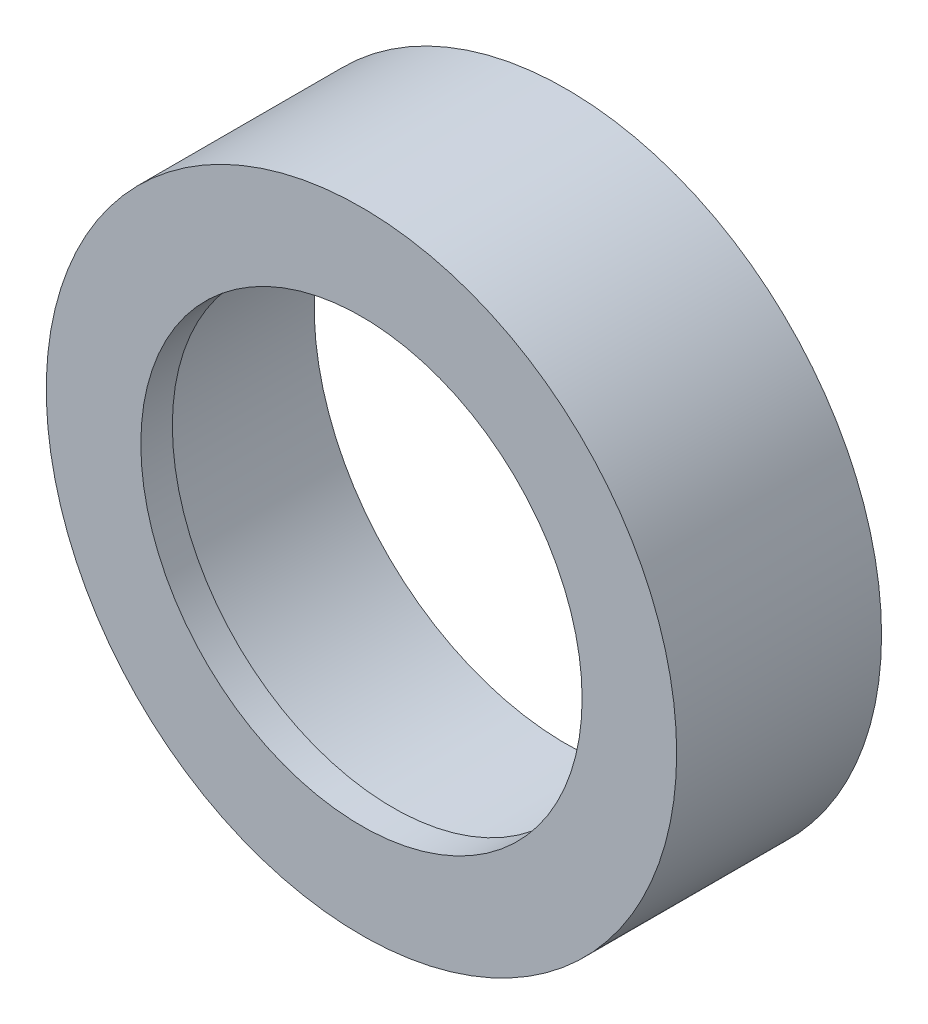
from build123d import *


with BuildPart() as part:
    # Esquisse2 → R_volution1 (revolve)
    with BuildSketch(Plane(origin=(0, 0, 0), x_dir=(0, 0, -1), z_dir=(1, 0, 0)), mode=Mode.PRIVATE) as r_volution1_sk:
        Polygon((0, 14), (0, 20), (13, 20), (13, 16), (2, 16), (2, 14), align=None)
    revolve(r_volution1_sk.sketch.rotate(Axis((0, 0, 0), (0, 0, -1)), 90), axis=Axis((0, 0, 0), (0, 0, -1)))


solid = part.part
